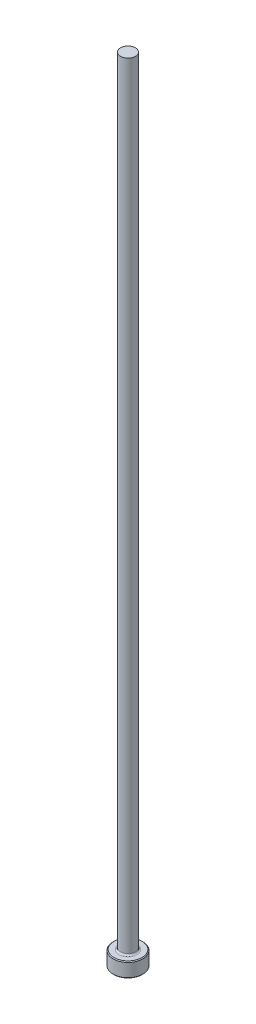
ISO-10303-21;
HEADER;
FILE_DESCRIPTION(('STEP AP214'),'2;1');
FILE_NAME('part.step','',(''),(''),'','','');
FILE_SCHEMA(('AUTOMOTIVE_DESIGN { 1 0 10303 214 1 1 1 1 }'));
ENDSEC;
DATA;
#1=APPLICATION_CONTEXT('core data for automotive mechanical design processes');
#2=APPLICATION_PROTOCOL_DEFINITION('international standard','automotive_design',2000,#1);
#3=PRODUCT_CONTEXT('',#1,'mechanical');
#4=PRODUCT('Part','Part','',(#3));
#5=PRODUCT_RELATED_PRODUCT_CATEGORY('part','',(#4));
#6=PRODUCT_DEFINITION_FORMATION('','',#4);
#7=PRODUCT_DEFINITION_CONTEXT('part definition',#1,'design');
#8=PRODUCT_DEFINITION('design','',#6,#7);
#9=PRODUCT_DEFINITION_SHAPE('','',#8);
#10=(LENGTH_UNIT() NAMED_UNIT(*) SI_UNIT(.MILLI.,.METRE.));
#11=(NAMED_UNIT(*) PLANE_ANGLE_UNIT() SI_UNIT($,.RADIAN.));
#12=(NAMED_UNIT(*) SI_UNIT($,.STERADIAN.) SOLID_ANGLE_UNIT());
#13=UNCERTAINTY_MEASURE_WITH_UNIT(LENGTH_MEASURE(1.E-05),#10,'distance_accuracy_value','');
#14=(GEOMETRIC_REPRESENTATION_CONTEXT(3) GLOBAL_UNCERTAINTY_ASSIGNED_CONTEXT((#13)) GLOBAL_UNIT_ASSIGNED_CONTEXT((#10,
#11,#12)) REPRESENTATION_CONTEXT('',''));
#15=CARTESIAN_POINT('',(0.,0.,0.));
#16=DIRECTION('',(0.,0.,1.));
#17=DIRECTION('',(1.,0.,0.));
#18=AXIS2_PLACEMENT_3D('',#15,#16,#17);
#19=CARTESIAN_POINT('',(0.,0.,0.));
#20=DIRECTION('',(0.,-1.,0.));
#21=DIRECTION('',(0.,0.,-1.));
#22=AXIS2_PLACEMENT_3D('',#19,#20,#21);
#23=PLANE('',#22);
#24=CARTESIAN_POINT('',(0.,0.,0.));
#25=DIRECTION('',(0.,-1.,0.));
#26=DIRECTION('',(0.,0.,-1.));
#27=AXIS2_PLACEMENT_3D('',#24,#25,#26);
#28=CIRCLE('',#27,4.5085);
#29=CARTESIAN_POINT('',(0.,0.,-4.5085));
#30=VERTEX_POINT('',#29);
#31=EDGE_CURVE('E46',#30,#30,#28,.T.);
#32=ORIENTED_EDGE('',*,*,#31,.T.);
#33=EDGE_LOOP('',(#32));
#34=FACE_BOUND('',#33,.T.);
#35=ADVANCED_FACE('F35',(#34),#23,.T.);
#36=CARTESIAN_POINT('',(0.,259.958771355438,0.));
#37=DIRECTION('',(0.,1.,0.));
#38=DIRECTION('',(0.,0.,1.));
#39=AXIS2_PLACEMENT_3D('',#36,#37,#38);
#40=CYLINDRICAL_SURFACE('',#39,4.76249999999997);
#41=CARTESIAN_POINT('',(0.,4.49580000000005,0.));
#42=DIRECTION('',(0.,1.,0.));
#43=DIRECTION('',(0.,0.,1.));
#44=AXIS2_PLACEMENT_3D('',#41,#42,#43);
#45=CIRCLE('',#44,4.76249999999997);
#46=CARTESIAN_POINT('',(0.,4.49580000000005,4.76249999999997));
#47=VERTEX_POINT('',#46);
#48=EDGE_CURVE('E50',#47,#47,#45,.F.);
#49=ORIENTED_EDGE('',*,*,#48,.T.);
#50=EDGE_LOOP('',(#49));
#51=FACE_BOUND('',#50,.T.);
#52=CARTESIAN_POINT('',(0.,0.254000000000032,0.));
#53=DIRECTION('',(0.,-1.,0.));
#54=DIRECTION('',(0.,0.,-1.));
#55=AXIS2_PLACEMENT_3D('',#52,#53,#54);
#56=CIRCLE('',#55,4.76249999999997);
#57=CARTESIAN_POINT('',(0.,0.254000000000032,-4.76249999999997));
#58=VERTEX_POINT('',#57);
#59=EDGE_CURVE('E55',#58,#58,#56,.F.);
#60=ORIENTED_EDGE('',*,*,#59,.T.);
#61=EDGE_LOOP('',(#60));
#62=FACE_BOUND('',#61,.T.);
#63=ADVANCED_FACE('F77',(#51,#62),#40,.T.);
#64=CARTESIAN_POINT('',(-4.76249999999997,4.7498,0.));
#65=DIRECTION('',(0.,1.,0.));
#66=DIRECTION('',(0.,0.,1.));
#67=AXIS2_PLACEMENT_3D('',#64,#65,#66);
#68=PLANE('',#67);
#69=CARTESIAN_POINT('',(0.,4.7498,0.));
#70=DIRECTION('',(0.,1.,0.));
#71=DIRECTION('',(0.,0.,1.));
#72=AXIS2_PLACEMENT_3D('',#69,#70,#71);
#73=CIRCLE('',#72,2.88924999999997);
#74=CARTESIAN_POINT('',(0.,4.7498,2.88924999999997));
#75=VERTEX_POINT('',#74);
#76=EDGE_CURVE('E10',#75,#75,#73,.F.);
#77=ORIENTED_EDGE('',*,*,#76,.T.);
#78=EDGE_LOOP('',(#77));
#79=FACE_BOUND('',#78,.T.);
#80=CARTESIAN_POINT('',(0.,4.7498,0.));
#81=DIRECTION('',(0.,1.,0.));
#82=DIRECTION('',(0.,0.,1.));
#83=AXIS2_PLACEMENT_3D('',#80,#81,#82);
#84=CIRCLE('',#83,4.50850000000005);
#85=CARTESIAN_POINT('',(0.,4.7498,4.50850000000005));
#86=VERTEX_POINT('',#85);
#87=EDGE_CURVE('E58',#86,#86,#84,.T.);
#88=ORIENTED_EDGE('',*,*,#87,.T.);
#89=EDGE_LOOP('',(#88));
#90=FACE_BOUND('',#89,.T.);
#91=ADVANCED_FACE('F69',(#79,#90),#68,.T.);
#92=CARTESIAN_POINT('',(0.,259.958771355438,0.));
#93=DIRECTION('',(0.,1.,0.));
#94=DIRECTION('',(0.,0.,1.));
#95=AXIS2_PLACEMENT_3D('',#92,#93,#94);
#96=CYLINDRICAL_SURFACE('',#95,2.38124999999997);
#97=CARTESIAN_POINT('',(0.,5.25779999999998,0.));
#98=DIRECTION('',(0.,1.,0.));
#99=DIRECTION('',(0.,0.,1.));
#100=AXIS2_PLACEMENT_3D('',#97,#98,#99);
#101=CIRCLE('',#100,2.38124999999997);
#102=CARTESIAN_POINT('',(0.,5.25779999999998,2.38124999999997));
#103=VERTEX_POINT('',#102);
#104=EDGE_CURVE('E42',#103,#103,#101,.T.);
#105=ORIENTED_EDGE('',*,*,#104,.T.);
#106=EDGE_LOOP('',(#105));
#107=FACE_BOUND('',#106,.T.);
#108=CARTESIAN_POINT('',(0.,254.,0.));
#109=DIRECTION('',(0.,1.,0.));
#110=DIRECTION('',(0.,0.,1.));
#111=AXIS2_PLACEMENT_3D('',#108,#109,#110);
#112=CIRCLE('',#111,2.38124999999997);
#113=CARTESIAN_POINT('',(0.,254.,2.38124999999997));
#114=VERTEX_POINT('',#113);
#115=EDGE_CURVE('E61',#114,#114,#112,.T.);
#116=ORIENTED_EDGE('',*,*,#115,.F.);
#117=EDGE_LOOP('',(#116));
#118=FACE_BOUND('',#117,.T.);
#119=ADVANCED_FACE('F67',(#107,#118),#96,.T.);
#120=CARTESIAN_POINT('',(-2.38124999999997,254.,0.));
#121=DIRECTION('',(0.,1.,0.));
#122=DIRECTION('',(0.,0.,1.));
#123=AXIS2_PLACEMENT_3D('',#120,#121,#122);
#124=PLANE('',#123);
#125=ORIENTED_EDGE('',*,*,#115,.T.);
#126=EDGE_LOOP('',(#125));
#127=FACE_BOUND('',#126,.T.);
#128=ADVANCED_FACE('F65',(#127),#124,.T.);
#129=CARTESIAN_POINT('',(0.,4.74980000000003,0.));
#130=DIRECTION('',(0.,-1.,0.));
#131=DIRECTION('',(0.,0.,-1.));
#132=AXIS2_PLACEMENT_3D('',#129,#130,#131);
#133=CONICAL_SURFACE('',#132,4.50850000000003,0.78539816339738);
#134=ORIENTED_EDGE('',*,*,#48,.F.);
#135=EDGE_LOOP('',(#134));
#136=FACE_BOUND('',#135,.T.);
#137=ORIENTED_EDGE('',*,*,#87,.F.);
#138=EDGE_LOOP('',(#137));
#139=FACE_BOUND('',#138,.T.);
#140=ADVANCED_FACE('F75',(#136,#139),#133,.T.);
#141=CARTESIAN_POINT('',(0.,0.254000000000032,0.));
#142=DIRECTION('',(0.,1.,0.));
#143=DIRECTION('',(0.,0.,1.));
#144=AXIS2_PLACEMENT_3D('',#141,#142,#143);
#145=CONICAL_SURFACE('',#144,4.76249999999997,0.785398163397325);
#146=ORIENTED_EDGE('',*,*,#31,.F.);
#147=EDGE_LOOP('',(#146));
#148=FACE_BOUND('',#147,.T.);
#149=ORIENTED_EDGE('',*,*,#59,.F.);
#150=EDGE_LOOP('',(#149));
#151=FACE_BOUND('',#150,.T.);
#152=ADVANCED_FACE('F89',(#148,#151),#145,.T.);
#153=CARTESIAN_POINT('',(0.,5.25779999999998,0.));
#154=DIRECTION('',(0.,1.,0.));
#155=DIRECTION('',(0.,0.,1.));
#156=AXIS2_PLACEMENT_3D('',#153,#154,#155);
#157=TOROIDAL_SURFACE('',#156,2.88924999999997,0.508);
#158=ORIENTED_EDGE('',*,*,#76,.F.);
#159=EDGE_LOOP('',(#158));
#160=FACE_BOUND('',#159,.T.);
#161=ORIENTED_EDGE('',*,*,#104,.F.);
#162=EDGE_LOOP('',(#161));
#163=FACE_BOUND('',#162,.T.);
#164=ADVANCED_FACE('F37',(#160,#163),#157,.F.);
#165=CLOSED_SHELL('',(#35,#63,#91,#119,#128,#140,#152,#164));
#166=MANIFOLD_SOLID_BREP('B2',#165);
#167=ADVANCED_BREP_SHAPE_REPRESENTATION('',(#18,#166),#14);
#168=SHAPE_DEFINITION_REPRESENTATION(#9,#167);
ENDSEC;
END-ISO-10303-21;
